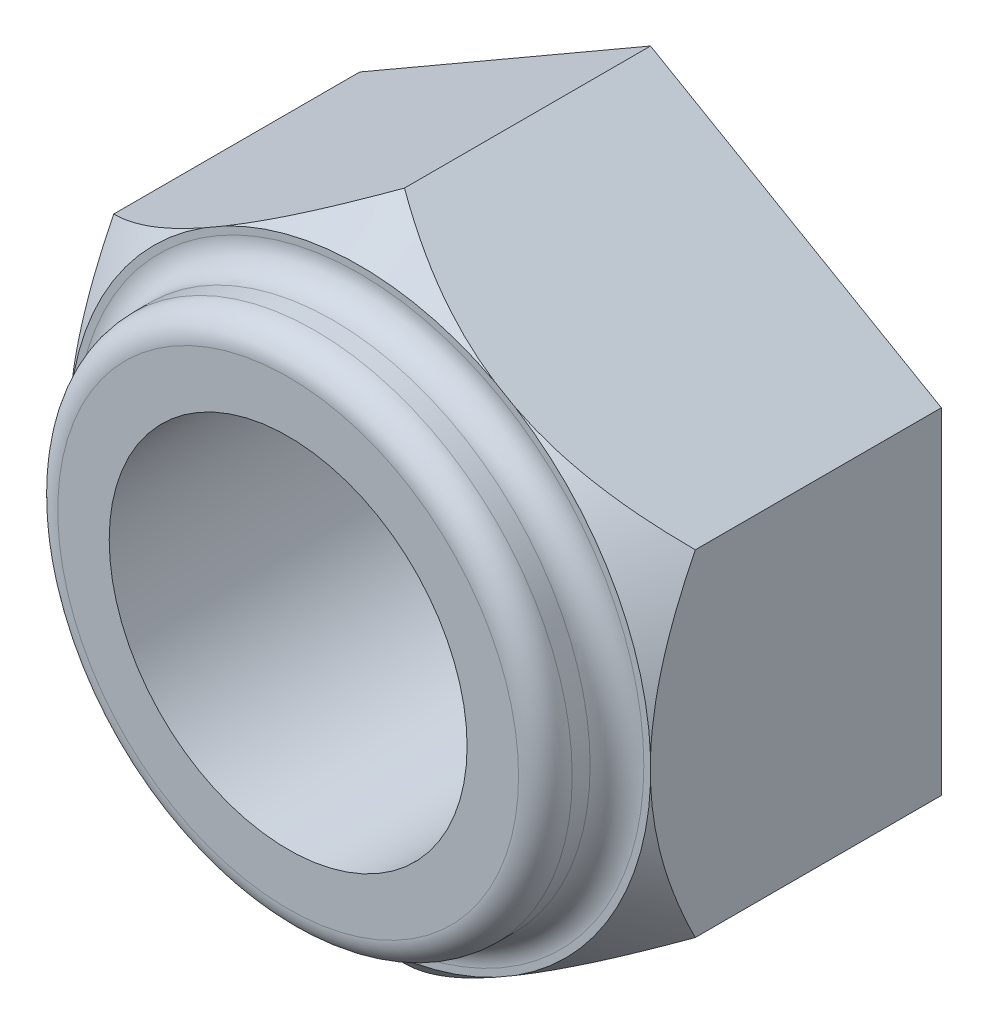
ISO-10303-21;
HEADER;
FILE_DESCRIPTION(('STEP AP214'),'2;1');
FILE_NAME('part.step','',(''),(''),'','','');
FILE_SCHEMA(('AUTOMOTIVE_DESIGN { 1 0 10303 214 1 1 1 1 }'));
ENDSEC;
DATA;
#1=APPLICATION_CONTEXT('core data for automotive mechanical design processes');
#2=APPLICATION_PROTOCOL_DEFINITION('international standard','automotive_design',2000,#1);
#3=PRODUCT_CONTEXT('',#1,'mechanical');
#4=PRODUCT('Part','Part','',(#3));
#5=PRODUCT_RELATED_PRODUCT_CATEGORY('part','',(#4));
#6=PRODUCT_DEFINITION_FORMATION('','',#4);
#7=PRODUCT_DEFINITION_CONTEXT('part definition',#1,'design');
#8=PRODUCT_DEFINITION('design','',#6,#7);
#9=PRODUCT_DEFINITION_SHAPE('','',#8);
#10=(LENGTH_UNIT() NAMED_UNIT(*) SI_UNIT(.MILLI.,.METRE.));
#11=(NAMED_UNIT(*) PLANE_ANGLE_UNIT() SI_UNIT($,.RADIAN.));
#12=(NAMED_UNIT(*) SI_UNIT($,.STERADIAN.) SOLID_ANGLE_UNIT());
#13=UNCERTAINTY_MEASURE_WITH_UNIT(LENGTH_MEASURE(1.E-05),#10,'distance_accuracy_value','');
#14=(GEOMETRIC_REPRESENTATION_CONTEXT(3) GLOBAL_UNCERTAINTY_ASSIGNED_CONTEXT((#13)) GLOBAL_UNIT_ASSIGNED_CONTEXT((#10,
#11,#12)) REPRESENTATION_CONTEXT('',''));
#15=CARTESIAN_POINT('',(0.,0.,0.));
#16=DIRECTION('',(0.,0.,1.));
#17=DIRECTION('',(1.,0.,0.));
#18=AXIS2_PLACEMENT_3D('',#15,#16,#17);
#19=CARTESIAN_POINT('',(-6.50000000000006,11.2583302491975,0.));
#20=DIRECTION('',(0.,0.,1.));
#21=DIRECTION('',(1.,0.,0.));
#22=AXIS2_PLACEMENT_3D('',#19,#20,#21);
#23=PLANE('',#22);
#24=CARTESIAN_POINT('',(0.,0.,0.));
#25=DIRECTION('',(0.,0.,1.));
#26=DIRECTION('',(1.,0.,0.));
#27=AXIS2_PLACEMENT_3D('',#24,#25,#26);
#28=CIRCLE('',#27,6.35);
#29=CARTESIAN_POINT('',(6.35000000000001,0.,0.));
#30=VERTEX_POINT('',#29);
#31=EDGE_CURVE('E174',#30,#30,#28,.F.);
#32=ORIENTED_EDGE('',*,*,#31,.T.);
#33=EDGE_LOOP('',(#32));
#34=FACE_BOUND('',#33,.T.);
#35=DIRECTION('',(0.,1.,0.));
#36=VECTOR('',#35,1.);
#37=CARTESIAN_POINT('',(6.50000000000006,-3.75277674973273,0.));
#38=LINE('',#37,#36);
#39=CARTESIAN_POINT('',(6.50000000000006,-0.268749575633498,0.));
#40=VERTEX_POINT('',#39);
#41=CARTESIAN_POINT('',(6.49999999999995,0.268749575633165,1.94289029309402E-13));
#42=VERTEX_POINT('',#41);
#43=EDGE_CURVE('E314',#40,#42,#38,.T.);
#44=ORIENTED_EDGE('',*,*,#43,.T.);
#45=CARTESIAN_POINT('',(0.,0.,0.));
#46=DIRECTION('',(0.,0.,1.));
#47=DIRECTION('',(1.,0.,0.));
#48=AXIS2_PLACEMENT_3D('',#45,#46,#47);
#49=CIRCLE('',#48,6.50555349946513);
#50=CARTESIAN_POINT('',(3.48274395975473,5.49479033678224,1.94289029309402E-13));
#51=VERTEX_POINT('',#50);
#52=EDGE_CURVE('E51',#42,#51,#49,.T.);
#53=ORIENTED_EDGE('',*,*,#52,.T.);
#54=DIRECTION('',(-0.866025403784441,0.500000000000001,0.));
#55=VECTOR('',#54,1.);
#56=CARTESIAN_POINT('',(6.49999999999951,3.75277674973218,1.94289029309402E-13));
#57=LINE('',#56,#55);
#58=CARTESIAN_POINT('',(3.01725604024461,5.76353991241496,1.94289029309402E-13));
#59=VERTEX_POINT('',#58);
#60=EDGE_CURVE('E139',#51,#59,#57,.T.);
#61=ORIENTED_EDGE('',*,*,#60,.T.);
#62=CARTESIAN_POINT('',(-3.01725604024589,5.76353991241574,1.94289029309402E-13));
#63=VERTEX_POINT('',#62);
#64=EDGE_CURVE('E338',#59,#63,#49,.T.);
#65=ORIENTED_EDGE('',*,*,#64,.T.);
#66=DIRECTION('',(-0.866025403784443,-0.500000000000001,0.));
#67=VECTOR('',#66,1.);
#68=CARTESIAN_POINT('',(-1.11022302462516E-13,7.50555349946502,1.94289029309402E-13));
#69=LINE('',#68,#67);
#70=CARTESIAN_POINT('',(-3.48274395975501,5.4947903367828,1.94289029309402E-13));
#71=VERTEX_POINT('',#70);
#72=EDGE_CURVE('E302',#63,#71,#69,.T.);
#73=ORIENTED_EDGE('',*,*,#72,.T.);
#74=CARTESIAN_POINT('',(-6.49999999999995,0.268749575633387,0.));
#75=VERTEX_POINT('',#74);
#76=EDGE_CURVE('E340',#71,#75,#49,.T.);
#77=ORIENTED_EDGE('',*,*,#76,.T.);
#78=DIRECTION('',(0.,-1.,0.));
#79=VECTOR('',#78,1.);
#80=CARTESIAN_POINT('',(-6.50000000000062,3.75277674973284,0.));
#81=LINE('',#80,#79);
#82=CARTESIAN_POINT('',(-6.49999999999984,-0.268749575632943,0.));
#83=VERTEX_POINT('',#82);
#84=EDGE_CURVE('E305',#75,#83,#81,.T.);
#85=ORIENTED_EDGE('',*,*,#84,.T.);
#86=CARTESIAN_POINT('',(-3.48274395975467,-5.49479033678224,0.));
#87=VERTEX_POINT('',#86);
#88=EDGE_CURVE('E341',#83,#87,#49,.T.);
#89=ORIENTED_EDGE('',*,*,#88,.T.);
#90=DIRECTION('',(0.866025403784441,-0.500000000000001,0.));
#91=VECTOR('',#90,1.);
#92=CARTESIAN_POINT('',(-6.49999999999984,-3.75277674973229,0.));
#93=LINE('',#92,#91);
#94=CARTESIAN_POINT('',(-3.01725604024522,-5.76353991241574,0.));
#95=VERTEX_POINT('',#94);
#96=EDGE_CURVE('E308',#87,#95,#93,.T.);
#97=ORIENTED_EDGE('',*,*,#96,.T.);
#98=CARTESIAN_POINT('',(3.01725604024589,-5.76353991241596,0.));
#99=VERTEX_POINT('',#98);
#100=EDGE_CURVE('E344',#95,#99,#49,.T.);
#101=ORIENTED_EDGE('',*,*,#100,.T.);
#102=DIRECTION('',(0.866025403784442,0.5,0.));
#103=VECTOR('',#102,1.);
#104=CARTESIAN_POINT('',(4.9960036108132E-13,-7.50555349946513,0.));
#105=LINE('',#104,#103);
#106=CARTESIAN_POINT('',(3.48274395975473,-5.49479033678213,0.));
#107=VERTEX_POINT('',#106);
#108=EDGE_CURVE('E311',#99,#107,#105,.T.);
#109=ORIENTED_EDGE('',*,*,#108,.T.);
#110=EDGE_CURVE('E59',#107,#40,#49,.T.);
#111=ORIENTED_EDGE('',*,*,#110,.T.);
#112=EDGE_LOOP('',(#44,#53,#61,#65,#73,#77,#85,#89,#97,#101,#109,#111));
#113=FACE_BOUND('',#112,.T.);
#114=ADVANCED_FACE('F31',(#34,#113),#23,.T.);
#115=CARTESIAN_POINT('',(6.49999999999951,3.7527767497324,-6.50000000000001));
#116=DIRECTION('',(0.5,0.86602540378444,0.));
#117=DIRECTION('',(-0.866025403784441,0.500000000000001,0.));
#118=AXIS2_PLACEMENT_3D('',#115,#116,#117);
#119=PLANE('',#118);
#120=ORIENTED_EDGE('',*,*,#60,.F.);
#121=CARTESIAN_POINT('',(3.47851283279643,5.49723317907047,0.000200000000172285));
#122=CARTESIAN_POINT('',(3.5679103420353,5.44561950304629,-0.00397825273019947));
#123=CARTESIAN_POINT('',(3.65720556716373,5.39406488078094,-0.010623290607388));
#124=CARTESIAN_POINT('',(3.83541266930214,5.29117696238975,-0.0286996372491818));
#125=CARTESIAN_POINT('',(3.92432462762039,5.23984361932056,-0.0401298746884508));
#126=CARTESIAN_POINT('',(4.18989853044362,5.08651445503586,-0.0813232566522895));
#127=CARTESIAN_POINT('',(4.36578196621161,4.98496810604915,-0.118008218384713));
#128=CARTESIAN_POINT('',(4.7119520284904,4.78510672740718,-0.207286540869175));
#129=CARTESIAN_POINT('',(4.88228200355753,4.68676667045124,-0.259661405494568));
#130=CARTESIAN_POINT('',(5.21932929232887,4.49217232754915,-0.37824151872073));
#131=CARTESIAN_POINT('',(5.38604537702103,4.39591875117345,-0.444451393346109));
#132=CARTESIAN_POINT('',(5.6314832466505,4.25421513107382,-0.551677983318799));
#133=CARTESIAN_POINT('',(5.71167686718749,4.20791532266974,-0.588300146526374));
#134=CARTESIAN_POINT('',(5.87114092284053,4.11584870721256,-0.664067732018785));
#135=CARTESIAN_POINT('',(5.95041161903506,4.07008174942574,-0.703212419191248));
#136=CARTESIAN_POINT('',(6.10860404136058,3.97874931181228,-0.784078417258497));
#137=CARTESIAN_POINT('',(6.18751971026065,3.93318732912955,-0.825815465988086));
#138=CARTESIAN_POINT('',(6.34449667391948,3.84255663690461,-0.911420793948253));
#139=CARTESIAN_POINT('',(6.42255781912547,3.79748801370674,-0.955289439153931));
#140=CARTESIAN_POINT('',(6.50019999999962,3.75266127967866,-1.0001154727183));
#141=B_SPLINE_CURVE_WITH_KNOTS('',3,(#121,#122,#123,#124,#125,#126,#127,#128,#129,#130,#131,
#132,#133,#134,#135,#136,#137,#138,#139,#140),.UNSPECIFIED.,.F.,.F.,(4,2,2,2,2,2,2,2,2,4),(0.,
0.309873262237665,0.619677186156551,1.23796054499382,1.84800516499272,2.45825409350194,
2.75696104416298,3.05558133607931,3.3562361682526,3.65694280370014),.UNSPECIFIED.);
#142=CARTESIAN_POINT('',(6.49999999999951,3.75277674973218,-0.999999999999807));
#143=VERTEX_POINT('',#142);
#144=EDGE_CURVE('E125',#51,#143,#141,.T.);
#145=ORIENTED_EDGE('',*,*,#144,.T.);
#146=DIRECTION('',(0.,0.,1.));
#147=VECTOR('',#146,1.);
#148=CARTESIAN_POINT('',(6.49999999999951,3.7527767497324,-6.50000000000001));
#149=LINE('',#148,#147);
#150=CARTESIAN_POINT('',(6.49999999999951,3.7527767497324,-6.50000000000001));
#151=VERTEX_POINT('',#150);
#152=EDGE_CURVE('E135',#151,#143,#149,.T.);
#153=ORIENTED_EDGE('',*,*,#152,.F.);
#154=DIRECTION('',(-0.866025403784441,0.500000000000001,0.));
#155=VECTOR('',#154,1.);
#156=CARTESIAN_POINT('',(6.49999999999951,3.7527767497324,-6.50000000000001));
#157=LINE('',#156,#155);
#158=CARTESIAN_POINT('',(-1.11022302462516E-13,7.50555349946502,-6.49999999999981));
#159=VERTEX_POINT('',#158);
#160=EDGE_CURVE('E316',#151,#159,#157,.T.);
#161=ORIENTED_EDGE('',*,*,#160,.T.);
#162=DIRECTION('',(0.,0.,1.));
#163=VECTOR('',#162,1.);
#164=CARTESIAN_POINT('',(-1.11022302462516E-13,7.50555349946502,-6.49999999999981));
#165=LINE('',#164,#163);
#166=CARTESIAN_POINT('',(-1.11022302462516E-13,7.50555349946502,-0.999999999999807));
#167=VERTEX_POINT('',#166);
#168=EDGE_CURVE('E166',#159,#167,#165,.T.);
#169=ORIENTED_EDGE('',*,*,#168,.T.);
#170=CARTESIAN_POINT('',(-0.00020000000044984,7.50566896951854,-1.0001154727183));
#171=CARTESIAN_POINT('',(0.0946604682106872,7.45090125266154,-0.945351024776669));
#172=CARTESIAN_POINT('',(0.190138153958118,7.39577718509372,-0.892016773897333));
#173=CARTESIAN_POINT('',(0.382429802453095,7.28475755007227,-0.788572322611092));
#174=CARTESIAN_POINT('',(0.479244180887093,7.22886174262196,-0.738463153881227));
#175=CARTESIAN_POINT('',(0.772467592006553,7.05956912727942,-0.593216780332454));
#176=CARTESIAN_POINT('',(0.970963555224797,6.94496742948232,-0.503567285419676));
#177=CARTESIAN_POINT('',(1.36924758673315,6.71501803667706,-0.344321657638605));
#178=CARTESIAN_POINT('',(1.5689191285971,6.5997376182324,-0.274340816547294));
#179=CARTESIAN_POINT('',(1.97273064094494,6.36659693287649,-0.15587332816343));
#180=CARTESIAN_POINT('',(2.17686159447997,6.24874187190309,-0.107346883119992));
#181=CARTESIAN_POINT('',(2.4881199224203,6.06903679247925,-0.0526022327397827));
#182=CARTESIAN_POINT('',(2.5940807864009,6.00786025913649,-0.0372885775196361));
#183=CARTESIAN_POINT('',(2.80713727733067,5.88485203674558,-0.0133715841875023));
#184=CARTESIAN_POINT('',(2.91423594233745,5.82301859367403,-0.00480445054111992));
#185=CARTESIAN_POINT('',(3.02148716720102,5.76109707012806,0.000200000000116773));
#186=B_SPLINE_CURVE_WITH_KNOTS('',3,(#170,#171,#172,#173,#174,#175,#176,#177,#178,#179,#180,
#181,#182,#183,#184,#185),.UNSPECIFIED.,.F.,.F.,(4,2,2,2,2,2,2,4),(0.,0.367367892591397,
0.734852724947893,1.4725117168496,2.19453828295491,2.9152198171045,3.28497390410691,
3.65669896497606),.UNSPECIFIED.);
#187=EDGE_CURVE('E204',#167,#59,#186,.T.);
#188=ORIENTED_EDGE('',*,*,#187,.T.);
#189=EDGE_LOOP('',(#120,#145,#153,#161,#169,#188));
#190=FACE_BOUND('',#189,.T.);
#191=ADVANCED_FACE('F33',(#190),#119,.T.);
#192=CARTESIAN_POINT('',(6.50000000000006,-3.75277674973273,-6.50000000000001));
#193=DIRECTION('',(1.,0.,0.));
#194=DIRECTION('',(0.,1.,0.));
#195=AXIS2_PLACEMENT_3D('',#192,#193,#194);
#196=PLANE('',#195);
#197=ORIENTED_EDGE('',*,*,#152,.T.);
#198=CARTESIAN_POINT('',(6.50000000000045,-7.83397785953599,-3.67389683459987));
#199=CARTESIAN_POINT('',(6.5000000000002,-7.64472126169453,-3.52828002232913));
#200=CARTESIAN_POINT('',(6.5000000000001,-7.45444516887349,-3.38396741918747));
#201=CARTESIAN_POINT('',(6.50000000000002,-7.07143720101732,-3.0985465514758));
#202=CARTESIAN_POINT('',(6.50000000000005,-6.87870475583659,-2.95743905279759));
#203=CARTESIAN_POINT('',(6.50000000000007,-6.48895888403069,-2.67802013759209));
#204=CARTESIAN_POINT('',(6.50000000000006,-6.29192390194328,-2.53973868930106));
#205=CARTESIAN_POINT('',(6.50000000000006,-5.89457513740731,-2.26798589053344));
#206=CARTESIAN_POINT('',(6.50000000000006,-5.69426158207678,-2.13451420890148));
#207=CARTESIAN_POINT('',(6.50000000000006,-5.27697243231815,-1.86519528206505));
#208=CARTESIAN_POINT('',(6.50000000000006,-5.05974606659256,-1.72973463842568));
#209=CARTESIAN_POINT('',(6.50000000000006,-4.62019196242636,-1.46721809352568));
#210=CARTESIAN_POINT('',(6.50000000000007,-4.39786337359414,-1.34016360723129));
#211=CARTESIAN_POINT('',(6.50000000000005,-3.94804348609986,-1.09716494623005));
#212=CARTESIAN_POINT('',(6.50000000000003,-3.72056994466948,-0.981188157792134));
#213=CARTESIAN_POINT('',(6.50000000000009,-3.2591910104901,-0.76294333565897));
#214=CARTESIAN_POINT('',(6.50000000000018,-3.02528871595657,-0.660668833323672));
#215=CARTESIAN_POINT('',(6.50000000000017,-2.57399161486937,-0.482780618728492));
#216=CARTESIAN_POINT('',(6.50000000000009,-2.35724810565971,-0.405531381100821));
#217=CARTESIAN_POINT('',(6.50000000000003,-1.91823719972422,-0.268381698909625));
#218=CARTESIAN_POINT('',(6.50000000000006,-1.69596945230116,-0.208482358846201));
#219=CARTESIAN_POINT('',(6.50000000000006,-1.2511098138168,-0.110273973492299));
#220=CARTESIAN_POINT('',(6.50000000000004,-1.0286060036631,-0.0715726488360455));
#221=CARTESIAN_POINT('',(6.50000000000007,-0.580831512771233,-0.0165680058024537));
#222=CARTESIAN_POINT('',(6.50000000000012,-0.355561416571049,-0.000260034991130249));
#223=CARTESIAN_POINT('',(6.50000000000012,0.0855836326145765,0.00856763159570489));
#224=CARTESIAN_POINT('',(6.50000000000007,0.301438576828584,0.00209655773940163));
#225=CARTESIAN_POINT('',(6.50000000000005,0.731465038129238,-0.031959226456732));
#226=CARTESIAN_POINT('',(6.50000000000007,0.945636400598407,-0.0595458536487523));
#227=CARTESIAN_POINT('',(6.50000000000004,1.37437544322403,-0.134741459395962));
#228=CARTESIAN_POINT('',(6.49999999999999,1.5888800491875,-0.182704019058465));
#229=CARTESIAN_POINT('',(6.50000000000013,2.01316513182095,-0.295989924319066));
#230=CARTESIAN_POINT('',(6.50000000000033,2.22294587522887,-0.361312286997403));
#231=CARTESIAN_POINT('',(6.50000000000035,2.64929633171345,-0.510614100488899));
#232=CARTESIAN_POINT('',(6.50000000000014,2.86556248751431,-0.595450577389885));
#233=CARTESIAN_POINT('',(6.49999999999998,3.29253231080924,-0.778230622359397));
#234=CARTESIAN_POINT('',(6.50000000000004,3.503233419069,-0.876180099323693));
#235=CARTESIAN_POINT('',(6.50000000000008,3.92006800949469,-1.08286332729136));
#236=CARTESIAN_POINT('',(6.50000000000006,4.1261848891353,-1.191630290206));
#237=CARTESIAN_POINT('',(6.50000000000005,4.53369568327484,-1.4175550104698));
#238=CARTESIAN_POINT('',(6.50000000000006,4.73509031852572,-1.53471147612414));
#239=CARTESIAN_POINT('',(6.50000000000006,5.12393114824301,-1.76982560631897));
#240=CARTESIAN_POINT('',(6.50000000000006,5.31157504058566,-1.88745803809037));
#241=CARTESIAN_POINT('',(6.50000000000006,5.68363895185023,-2.12773023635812));
#242=CARTESIAN_POINT('',(6.50000000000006,5.86805872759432,-2.25037037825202));
#243=CARTESIAN_POINT('',(6.50000000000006,6.23261356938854,-2.49876669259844));
#244=CARTESIAN_POINT('',(6.50000000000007,6.41277114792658,-2.62448994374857));
#245=CARTESIAN_POINT('',(6.50000000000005,6.77061474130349,-2.87930687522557));
#246=CARTESIAN_POINT('',(6.50000000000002,6.94830142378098,-3.00839961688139));
#247=CARTESIAN_POINT('',(6.49999999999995,7.12495159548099,-3.13887158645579));
#248=B_SPLINE_CURVE_WITH_KNOTS('',3,(#198,#199,#200,#201,#202,#203,#204,#205,#206,#207,#208,
#209,#210,#211,#212,#213,#214,#215,#216,#217,#218,#219,#220,#221,#222,#223,#224,#225,#226,#227,
#228,#229,#230,#231,#232,#233,#234,#235,#236,#237,#238,#239,#240,#241,#242,#243,#244,#245,#246,
#247),.UNSPECIFIED.,.F.,.F.,(4,2,2,2,2,2,2,2,2,2,2,2,2,2,2,2,2,2,2,2,2,2,2,2,4),(0.,
0.716393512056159,1.43295644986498,2.15504732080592,2.87708837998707,3.64494230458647,
4.41292515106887,5.17857239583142,5.94385690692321,6.6335567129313,7.32330041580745,
7.99980722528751,8.67617346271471,9.32295751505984,9.96980028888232,10.6283582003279,
11.2868788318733,11.983277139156,12.679990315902,13.378912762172,14.0777278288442,
14.7420355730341,15.4063932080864,16.0654171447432,16.7242594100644),.UNSPECIFIED.);
#249=EDGE_CURVE('E122',#143,#42,#248,.F.);
#250=ORIENTED_EDGE('',*,*,#249,.T.);
#251=ORIENTED_EDGE('',*,*,#43,.F.);
#252=CARTESIAN_POINT('',(6.50000000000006,-3.75277674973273,-1.));
#253=VERTEX_POINT('',#252);
#254=EDGE_CURVE('E130',#40,#253,#248,.F.);
#255=ORIENTED_EDGE('',*,*,#254,.T.);
#256=DIRECTION('',(0.,0.,1.));
#257=VECTOR('',#256,1.);
#258=CARTESIAN_POINT('',(6.50000000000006,-3.75277674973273,-6.50000000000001));
#259=LINE('',#258,#257);
#260=CARTESIAN_POINT('',(6.50000000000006,-3.75277674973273,-6.50000000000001));
#261=VERTEX_POINT('',#260);
#262=EDGE_CURVE('E147',#261,#253,#259,.T.);
#263=ORIENTED_EDGE('',*,*,#262,.F.);
#264=DIRECTION('',(0.,1.,0.));
#265=VECTOR('',#264,1.);
#266=CARTESIAN_POINT('',(6.50000000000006,-3.75277674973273,-6.50000000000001));
#267=LINE('',#266,#265);
#268=EDGE_CURVE('E145',#261,#151,#267,.T.);
#269=ORIENTED_EDGE('',*,*,#268,.T.);
#270=EDGE_LOOP('',(#197,#250,#251,#255,#263,#269));
#271=FACE_BOUND('',#270,.T.);
#272=ADVANCED_FACE('F143',(#271),#196,.T.);
#273=CARTESIAN_POINT('',(4.9960036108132E-13,-7.50555349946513,-6.50000000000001));
#274=DIRECTION('',(0.500000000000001,-0.866025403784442,0.));
#275=DIRECTION('',(0.866025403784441,0.5,0.));
#276=AXIS2_PLACEMENT_3D('',#273,#274,#275);
#277=PLANE('',#276);
#278=ORIENTED_EDGE('',*,*,#108,.F.);
#279=CARTESIAN_POINT('',(3.02148716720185,-5.76109707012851,0.000199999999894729));
#280=CARTESIAN_POINT('',(2.93208965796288,-5.81271074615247,-0.00397825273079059));
#281=CARTESIAN_POINT('',(2.84279443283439,-5.86426536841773,-0.010623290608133));
#282=CARTESIAN_POINT('',(2.66458733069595,-5.96715328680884,-0.0286996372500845));
#283=CARTESIAN_POINT('',(2.5756753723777,-6.01848662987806,-0.0401298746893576));
#284=CARTESIAN_POINT('',(2.31010146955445,-6.17181579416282,-0.0813232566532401));
#285=CARTESIAN_POINT('',(2.1342180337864,-6.27336214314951,-0.118008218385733));
#286=CARTESIAN_POINT('',(1.78804797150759,-6.47322352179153,-0.207286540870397));
#287=CARTESIAN_POINT('',(1.61771799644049,-6.57156357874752,-0.259661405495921));
#288=CARTESIAN_POINT('',(1.28067070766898,-6.76615792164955,-0.378241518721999));
#289=CARTESIAN_POINT('',(1.11395462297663,-6.86241149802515,-0.444451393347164));
#290=CARTESIAN_POINT('',(0.868516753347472,-7.00411511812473,-0.551677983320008));
#291=CARTESIAN_POINT('',(0.788323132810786,-7.05041492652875,-0.588300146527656));
#292=CARTESIAN_POINT('',(0.62885907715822,-7.14248154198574,-0.664067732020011));
#293=CARTESIAN_POINT('',(0.549588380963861,-7.18824849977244,-0.703212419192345));
#294=CARTESIAN_POINT('',(0.391395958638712,-7.27958093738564,-0.784078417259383));
#295=CARTESIAN_POINT('',(0.312480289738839,-7.32514292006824,-0.82581546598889));
#296=CARTESIAN_POINT('',(0.155503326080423,-7.41577361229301,-0.911420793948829));
#297=CARTESIAN_POINT('',(0.0774421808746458,-7.46084223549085,-0.955289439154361));
#298=CARTESIAN_POINT('',(-0.000199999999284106,-7.50566896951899,-1.0001154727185));
#299=B_SPLINE_CURVE_WITH_KNOTS('',3,(#279,#280,#281,#282,#283,#284,#285,#286,#287,#288,#289,
#290,#291,#292,#293,#294,#295,#296,#297,#298),.UNSPECIFIED.,.F.,.F.,(4,2,2,2,2,2,2,2,2,4),(0.,
0.309873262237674,0.619677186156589,1.237960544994,1.84800516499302,2.45825409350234,
2.75696104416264,3.05558133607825,3.3562361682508,3.65694280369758),.UNSPECIFIED.);
#300=CARTESIAN_POINT('',(4.9960036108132E-13,-7.50555349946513,-1.));
#301=VERTEX_POINT('',#300);
#302=EDGE_CURVE('E223',#99,#301,#299,.T.);
#303=ORIENTED_EDGE('',*,*,#302,.T.);
#304=DIRECTION('',(0.,0.,1.));
#305=VECTOR('',#304,1.);
#306=CARTESIAN_POINT('',(4.9960036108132E-13,-7.50555349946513,-6.50000000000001));
#307=LINE('',#306,#305);
#308=CARTESIAN_POINT('',(4.9960036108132E-13,-7.50555349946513,-6.50000000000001));
#309=VERTEX_POINT('',#308);
#310=EDGE_CURVE('E153',#309,#301,#307,.T.);
#311=ORIENTED_EDGE('',*,*,#310,.F.);
#312=DIRECTION('',(0.866025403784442,0.5,0.));
#313=VECTOR('',#312,1.);
#314=CARTESIAN_POINT('',(4.9960036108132E-13,-7.50555349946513,-6.50000000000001));
#315=LINE('',#314,#313);
#316=EDGE_CURVE('E326',#309,#261,#315,.T.);
#317=ORIENTED_EDGE('',*,*,#316,.T.);
#318=ORIENTED_EDGE('',*,*,#262,.T.);
#319=CARTESIAN_POINT('',(6.50020000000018,-3.75266127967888,-1.0001154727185));
#320=CARTESIAN_POINT('',(6.40533953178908,-3.80742899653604,-0.945351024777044));
#321=CARTESIAN_POINT('',(6.30986184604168,-3.86255306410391,-0.892016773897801));
#322=CARTESIAN_POINT('',(6.11757019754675,-3.97357269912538,-0.788572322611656));
#323=CARTESIAN_POINT('',(6.02075581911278,-4.02946850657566,-0.738463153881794));
#324=CARTESIAN_POINT('',(5.72753240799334,-4.19876112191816,-0.593216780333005));
#325=CARTESIAN_POINT('',(5.52903644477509,-4.31336281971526,-0.503567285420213));
#326=CARTESIAN_POINT('',(5.13075241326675,-4.54331221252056,-0.344321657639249));
#327=CARTESIAN_POINT('',(4.93108087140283,-4.65859263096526,-0.274340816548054));
#328=CARTESIAN_POINT('',(4.52726935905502,-4.89173331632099,-0.155873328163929));
#329=CARTESIAN_POINT('',(4.32313840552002,-5.00958837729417,-0.107346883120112));
#330=CARTESIAN_POINT('',(4.01188007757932,-5.18929345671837,-0.0526022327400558));
#331=CARTESIAN_POINT('',(3.90591921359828,-5.2504699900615,-0.0372885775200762));
#332=CARTESIAN_POINT('',(3.69286272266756,-5.373478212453,-0.0133715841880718));
#333=CARTESIAN_POINT('',(3.58576405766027,-5.43531165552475,-0.00480445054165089));
#334=CARTESIAN_POINT('',(3.4785128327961,-5.49723317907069,0.000200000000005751));
#335=B_SPLINE_CURVE_WITH_KNOTS('',3,(#319,#320,#321,#322,#323,#324,#325,#326,#327,#328,#329,
#330,#331,#332,#333,#334),.UNSPECIFIED.,.F.,.F.,(4,2,2,2,2,2,2,4),(0.,0.367367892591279,
0.734852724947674,1.47251171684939,2.19453828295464,2.91521981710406,3.28497390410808,
3.65669896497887),.UNSPECIFIED.);
#336=EDGE_CURVE('E229',#253,#107,#335,.T.);
#337=ORIENTED_EDGE('',*,*,#336,.T.);
#338=EDGE_LOOP('',(#278,#303,#311,#317,#318,#337));
#339=FACE_BOUND('',#338,.T.);
#340=ADVANCED_FACE('F245',(#339),#277,.T.);
#341=CARTESIAN_POINT('',(-6.49999999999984,-3.75277674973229,-6.50000000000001));
#342=DIRECTION('',(-0.500000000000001,-0.86602540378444,0.));
#343=DIRECTION('',(0.866025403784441,-0.500000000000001,0.));
#344=AXIS2_PLACEMENT_3D('',#341,#342,#343);
#345=PLANE('',#344);
#346=ORIENTED_EDGE('',*,*,#96,.F.);
#347=CARTESIAN_POINT('',(-3.4785128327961,-5.4972331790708,0.000200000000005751));
#348=CARTESIAN_POINT('',(-3.56791034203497,-5.44561950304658,-0.00397825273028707));
#349=CARTESIAN_POINT('',(-3.65720556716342,-5.39406488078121,-0.0106232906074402));
#350=CARTESIAN_POINT('',(-3.83541266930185,-5.29117696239,-0.0286996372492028));
#351=CARTESIAN_POINT('',(-3.92432462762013,-5.2398436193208,-0.040129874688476));
#352=CARTESIAN_POINT('',(-4.18989853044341,-5.08651445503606,-0.0813232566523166));
#353=CARTESIAN_POINT('',(-4.36578196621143,-4.98496810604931,-0.118008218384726));
#354=CARTESIAN_POINT('',(-4.71195202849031,-4.78510672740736,-0.207286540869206));
#355=CARTESIAN_POINT('',(-4.8822820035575,-4.68676667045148,-0.259661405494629));
#356=CARTESIAN_POINT('',(-5.21932929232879,-4.49217232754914,-0.378241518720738));
#357=CARTESIAN_POINT('',(-5.38604537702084,-4.39591875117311,-0.444451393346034));
#358=CARTESIAN_POINT('',(-5.63148324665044,-4.25421513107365,-0.551677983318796));
#359=CARTESIAN_POINT('',(-5.71167686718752,-4.20791532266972,-0.588300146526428));
#360=CARTESIAN_POINT('',(-5.87114092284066,-4.11584870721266,-0.664067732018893));
#361=CARTESIAN_POINT('',(-5.95041161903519,-4.07008174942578,-0.703212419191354));
#362=CARTESIAN_POINT('',(-6.10860404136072,-3.97874931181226,-0.784078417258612));
#363=CARTESIAN_POINT('',(-6.18751971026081,-3.93318732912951,-0.825815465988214));
#364=CARTESIAN_POINT('',(-6.3444966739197,-3.8425566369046,-0.911420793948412));
#365=CARTESIAN_POINT('',(-6.42255781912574,-3.79748801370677,-0.955289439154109));
#366=CARTESIAN_POINT('',(-6.50019999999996,-3.75266127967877,-1.0001154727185));
#367=B_SPLINE_CURVE_WITH_KNOTS('',3,(#347,#348,#349,#350,#351,#352,#353,#354,#355,#356,#357,
#358,#359,#360,#361,#362,#363,#364,#365,#366),.UNSPECIFIED.,.F.,.F.,(4,2,2,2,2,2,2,2,2,4),(0.,
0.309873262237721,0.619677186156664,1.23796054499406,1.84800516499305,2.45825409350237,
2.75696104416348,3.05558133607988,3.35623616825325,3.65694280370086),.UNSPECIFIED.);
#368=CARTESIAN_POINT('',(-6.49999999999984,-3.75277674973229,-1.));
#369=VERTEX_POINT('',#368);
#370=EDGE_CURVE('E210',#87,#369,#367,.T.);
#371=ORIENTED_EDGE('',*,*,#370,.T.);
#372=DIRECTION('',(0.,0.,1.));
#373=VECTOR('',#372,1.);
#374=CARTESIAN_POINT('',(-6.49999999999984,-3.75277674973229,-6.50000000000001));
#375=LINE('',#374,#373);
#376=CARTESIAN_POINT('',(-6.49999999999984,-3.75277674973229,-6.50000000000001));
#377=VERTEX_POINT('',#376);
#378=EDGE_CURVE('E160',#377,#369,#375,.T.);
#379=ORIENTED_EDGE('',*,*,#378,.F.);
#380=DIRECTION('',(0.866025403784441,-0.500000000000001,0.));
#381=VECTOR('',#380,1.);
#382=CARTESIAN_POINT('',(-6.49999999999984,-3.75277674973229,-6.50000000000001));
#383=LINE('',#382,#381);
#384=EDGE_CURVE('E324',#377,#309,#383,.T.);
#385=ORIENTED_EDGE('',*,*,#384,.T.);
#386=ORIENTED_EDGE('',*,*,#310,.T.);
#387=CARTESIAN_POINT('',(0.000200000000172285,-7.50566896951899,-1.0001154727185));
#388=CARTESIAN_POINT('',(-0.0946604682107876,-7.45090125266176,-0.945351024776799));
#389=CARTESIAN_POINT('',(-0.190138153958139,-7.39577718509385,-0.892016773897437));
#390=CARTESIAN_POINT('',(-0.382429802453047,-7.28475755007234,-0.788572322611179));
#391=CARTESIAN_POINT('',(-0.479244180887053,-7.22886174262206,-0.738463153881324));
#392=CARTESIAN_POINT('',(-0.772467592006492,-7.05956912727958,-0.593216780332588));
#393=CARTESIAN_POINT('',(-0.970963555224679,-6.94496742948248,-0.50356728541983));
#394=CARTESIAN_POINT('',(-1.36924758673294,-6.71501803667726,-0.344321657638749));
#395=CARTESIAN_POINT('',(-1.56891912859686,-6.59973761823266,-0.274340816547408));
#396=CARTESIAN_POINT('',(-1.97273064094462,-6.36659693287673,-0.155873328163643));
#397=CARTESIAN_POINT('',(-2.1768615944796,-6.24874187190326,-0.107346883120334));
#398=CARTESIAN_POINT('',(-2.48811992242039,-6.06903679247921,-0.0526022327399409));
#399=CARTESIAN_POINT('',(-2.59408078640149,-6.00786025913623,-0.0372885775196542));
#400=CARTESIAN_POINT('',(-2.80713727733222,-5.88485203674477,-0.0133715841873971));
#401=CARTESIAN_POINT('',(-2.91423594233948,-5.82301859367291,-0.0048044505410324));
#402=CARTESIAN_POINT('',(-3.02148716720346,-5.76109707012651,0.000200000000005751));
#403=B_SPLINE_CURVE_WITH_KNOTS('',3,(#387,#388,#389,#390,#391,#392,#393,#394,#395,#396,#397,
#398,#399,#400,#401,#402),.UNSPECIFIED.,.F.,.F.,(4,2,2,2,2,2,2,4),(0.,0.36736789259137,
0.734852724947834,1.47251171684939,2.19453828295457,2.91521981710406,3.28497390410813,
3.65669896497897),.UNSPECIFIED.);
#404=EDGE_CURVE('E217',#301,#95,#403,.T.);
#405=ORIENTED_EDGE('',*,*,#404,.T.);
#406=EDGE_LOOP('',(#346,#371,#379,#385,#386,#405));
#407=FACE_BOUND('',#406,.T.);
#408=ADVANCED_FACE('F250',(#407),#345,.T.);
#409=CARTESIAN_POINT('',(-6.50000000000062,3.75277674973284,-6.50000000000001));
#410=DIRECTION('',(-1.,0.,0.));
#411=DIRECTION('',(0.,-1.,0.));
#412=AXIS2_PLACEMENT_3D('',#409,#410,#411);
#413=PLANE('',#412);
#414=ORIENTED_EDGE('',*,*,#378,.T.);
#415=CARTESIAN_POINT('',(-6.49999999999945,-7.83397785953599,-3.67389683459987));
#416=CARTESIAN_POINT('',(-6.5000000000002,-7.64472126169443,-3.52828002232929));
#417=CARTESIAN_POINT('',(-6.50000000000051,-7.45444516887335,-3.3839674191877));
#418=CARTESIAN_POINT('',(-6.50000000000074,-7.07143720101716,-3.09854655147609));
#419=CARTESIAN_POINT('',(-6.50000000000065,-6.87870475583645,-2.95743905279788));
#420=CARTESIAN_POINT('',(-6.50000000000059,-6.48895888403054,-2.67802013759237));
#421=CARTESIAN_POINT('',(-6.50000000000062,-6.29192390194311,-2.53973868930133));
#422=CARTESIAN_POINT('',(-6.50000000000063,-5.89457513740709,-2.26798589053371));
#423=CARTESIAN_POINT('',(-6.50000000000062,-5.69426158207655,-2.13451420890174));
#424=CARTESIAN_POINT('',(-6.50000000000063,-5.27697243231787,-1.86519528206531));
#425=CARTESIAN_POINT('',(-6.50000000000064,-5.05974606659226,-1.72973463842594));
#426=CARTESIAN_POINT('',(-6.5000000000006,-4.62019196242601,-1.46721809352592));
#427=CARTESIAN_POINT('',(-6.50000000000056,-4.39786337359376,-1.3401636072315));
#428=CARTESIAN_POINT('',(-6.50000000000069,-3.94804348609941,-1.09716494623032));
#429=CARTESIAN_POINT('',(-6.50000000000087,-3.72056994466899,-0.981188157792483));
#430=CARTESIAN_POINT('',(-6.50000000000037,-3.25919101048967,-0.762943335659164));
#431=CARTESIAN_POINT('',(-6.49999999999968,-3.02528871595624,-0.660668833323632));
#432=CARTESIAN_POINT('',(-6.49999999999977,-2.57399161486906,-0.482780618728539));
#433=CARTESIAN_POINT('',(-6.50000000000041,-2.35724810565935,-0.405531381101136));
#434=CARTESIAN_POINT('',(-6.50000000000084,-1.91823719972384,-0.268381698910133));
#435=CARTESIAN_POINT('',(-6.50000000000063,-1.69596945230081,-0.208482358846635));
#436=CARTESIAN_POINT('',(-6.50000000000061,-1.25110981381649,-0.110273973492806));
#437=CARTESIAN_POINT('',(-6.50000000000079,-1.0286060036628,-0.0715726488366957));
#438=CARTESIAN_POINT('',(-6.50000000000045,-0.580831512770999,-0.016568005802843));
#439=CARTESIAN_POINT('',(-6.49999999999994,-0.35556141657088,-0.000260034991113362));
#440=CARTESIAN_POINT('',(-6.49999999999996,0.0855836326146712,0.00856763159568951));
#441=CARTESIAN_POINT('',(-6.50000000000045,0.30143857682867,0.00209655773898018));
#442=CARTESIAN_POINT('',(-6.50000000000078,0.73146503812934,-0.0319592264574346));
#443=CARTESIAN_POINT('',(-6.50000000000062,0.945636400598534,-0.0595458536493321));
#444=CARTESIAN_POINT('',(-6.50000000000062,1.37437544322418,-0.134741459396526));
#445=CARTESIAN_POINT('',(-6.50000000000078,1.58888004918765,-0.182704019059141));
#446=CARTESIAN_POINT('',(-6.50000000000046,2.01316513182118,-0.295989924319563));
#447=CARTESIAN_POINT('',(-6.49999999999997,2.2229458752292,-0.361312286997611));
#448=CARTESIAN_POINT('',(-6.49999999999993,2.64929633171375,-0.510614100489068));
#449=CARTESIAN_POINT('',(-6.50000000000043,2.86556248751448,-0.595450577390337));
#450=CARTESIAN_POINT('',(-6.5000000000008,3.2925323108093,-0.778230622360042));
#451=CARTESIAN_POINT('',(-6.50000000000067,3.50323341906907,-0.876180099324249));
#452=CARTESIAN_POINT('',(-6.50000000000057,3.92006800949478,-1.08286332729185));
#453=CARTESIAN_POINT('',(-6.5000000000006,4.12618488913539,-1.19163029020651));
#454=CARTESIAN_POINT('',(-6.50000000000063,4.53369568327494,-1.41755501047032));
#455=CARTESIAN_POINT('',(-6.50000000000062,4.73509031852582,-1.53471147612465));
#456=CARTESIAN_POINT('',(-6.50000000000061,5.12393114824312,-1.76982560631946));
#457=CARTESIAN_POINT('',(-6.50000000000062,5.31157504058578,-1.88745803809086));
#458=CARTESIAN_POINT('',(-6.50000000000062,5.68363895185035,-2.12773023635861));
#459=CARTESIAN_POINT('',(-6.50000000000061,5.86805872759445,-2.2503703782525));
#460=CARTESIAN_POINT('',(-6.50000000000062,6.23261356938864,-2.49876669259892));
#461=CARTESIAN_POINT('',(-6.50000000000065,6.41277114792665,-2.62448994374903));
#462=CARTESIAN_POINT('',(-6.50000000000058,6.77061474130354,-2.87930687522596));
#463=CARTESIAN_POINT('',(-6.5000000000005,6.94830142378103,-3.00839961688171));
#464=CARTESIAN_POINT('',(-6.50000000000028,7.1249515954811,-3.13887158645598));
#465=B_SPLINE_CURVE_WITH_KNOTS('',3,(#415,#416,#417,#418,#419,#420,#421,#422,#423,#424,#425,
#426,#427,#428,#429,#430,#431,#432,#433,#434,#435,#436,#437,#438,#439,#440,#441,#442,#443,#444,
#445,#446,#447,#448,#449,#450,#451,#452,#453,#454,#455,#456,#457,#458,#459,#460,#461,#462,#463,
#464),.UNSPECIFIED.,.F.,.F.,(4,2,2,2,2,2,2,2,2,2,2,2,2,2,2,2,2,2,2,2,2,2,2,2,4),(0.,
0.716393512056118,1.43295644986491,2.15504732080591,2.87708837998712,3.64494230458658,
4.41292515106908,5.17857239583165,5.94385690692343,6.63355671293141,7.32330041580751,
7.99980722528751,8.67617346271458,9.3229575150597,9.96980028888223,10.6283582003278,
11.2868788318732,11.9832771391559,12.6799903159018,13.3789127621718,14.0777278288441,
14.742035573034,15.4063932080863,16.0654171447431,16.7242594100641),.UNSPECIFIED.);
#466=EDGE_CURVE('E350',#369,#83,#465,.T.);
#467=ORIENTED_EDGE('',*,*,#466,.T.);
#468=ORIENTED_EDGE('',*,*,#84,.F.);
#469=CARTESIAN_POINT('',(-6.50000000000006,3.75277674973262,-1.));
#470=VERTEX_POINT('',#469);
#471=EDGE_CURVE('E197',#75,#470,#465,.T.);
#472=ORIENTED_EDGE('',*,*,#471,.T.);
#473=DIRECTION('',(0.,0.,1.));
#474=VECTOR('',#473,1.);
#475=CARTESIAN_POINT('',(-6.50000000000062,3.75277674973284,-6.50000000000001));
#476=LINE('',#475,#474);
#477=CARTESIAN_POINT('',(-6.50000000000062,3.75277674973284,-6.50000000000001));
#478=VERTEX_POINT('',#477);
#479=EDGE_CURVE('E163',#478,#470,#476,.T.);
#480=ORIENTED_EDGE('',*,*,#479,.F.);
#481=DIRECTION('',(0.,-1.,0.));
#482=VECTOR('',#481,1.);
#483=CARTESIAN_POINT('',(-6.50000000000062,3.75277674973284,-6.50000000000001));
#484=LINE('',#483,#482);
#485=EDGE_CURVE('E321',#478,#377,#484,.T.);
#486=ORIENTED_EDGE('',*,*,#485,.T.);
#487=EDGE_LOOP('',(#414,#467,#468,#472,#480,#486));
#488=FACE_BOUND('',#487,.T.);
#489=ADVANCED_FACE('F255',(#488),#413,.T.);
#490=CARTESIAN_POINT('',(-1.11022302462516E-13,7.50555349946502,-6.49999999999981));
#491=DIRECTION('',(-0.500000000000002,0.866025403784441,0.));
#492=DIRECTION('',(-0.866025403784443,-0.500000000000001,0.));
#493=AXIS2_PLACEMENT_3D('',#490,#491,#492);
#494=PLANE('',#493);
#495=ORIENTED_EDGE('',*,*,#72,.F.);
#496=CARTESIAN_POINT('',(-3.02148716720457,5.76109707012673,0.00020000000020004));
#497=CARTESIAN_POINT('',(-2.93208965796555,5.81271074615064,-0.00397825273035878));
#498=CARTESIAN_POINT('',(-2.84279443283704,5.86426536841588,-0.0106232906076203));
#499=CARTESIAN_POINT('',(-2.66458733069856,5.96715328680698,-0.0286996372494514));
#500=CARTESIAN_POINT('',(-2.57567537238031,6.01848662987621,-0.0401298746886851));
#501=CARTESIAN_POINT('',(-2.31010146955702,6.17181579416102,-0.0813232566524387));
#502=CARTESIAN_POINT('',(-2.13421803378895,6.27336214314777,-0.118008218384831));
#503=CARTESIAN_POINT('',(-1.78804797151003,6.47322352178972,-0.207286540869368));
#504=CARTESIAN_POINT('',(-1.61771799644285,6.57156357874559,-0.259661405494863));
#505=CARTESIAN_POINT('',(-1.28067070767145,6.76615792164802,-0.378241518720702));
#506=CARTESIAN_POINT('',(-1.1139546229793,6.86241149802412,-0.444451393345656));
#507=CARTESIAN_POINT('',(-0.868516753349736,7.00411511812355,-0.551677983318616));
#508=CARTESIAN_POINT('',(-0.788323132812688,7.05041492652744,-0.588300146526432));
#509=CARTESIAN_POINT('',(-0.628859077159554,7.14248154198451,-0.664067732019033));
#510=CARTESIAN_POINT('',(-0.549588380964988,7.18824849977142,-0.703212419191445));
#511=CARTESIAN_POINT('',(-0.391395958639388,7.27958093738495,-0.784078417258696));
#512=CARTESIAN_POINT('',(-0.31248028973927,7.32514292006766,-0.825815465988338));
#513=CARTESIAN_POINT('',(-0.155503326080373,7.41577361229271,-0.911420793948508));
#514=CARTESIAN_POINT('',(-0.0774421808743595,7.4608422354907,-0.955289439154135));
#515=CARTESIAN_POINT('',(0.000199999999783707,7.5056689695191,-1.0001154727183));
#516=B_SPLINE_CURVE_WITH_KNOTS('',3,(#496,#497,#498,#499,#500,#501,#502,#503,#504,#505,#506,
#507,#508,#509,#510,#511,#512,#513,#514,#515),.UNSPECIFIED.,.F.,.F.,(4,2,2,2,2,2,2,2,2,4),(0.,
0.309873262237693,0.619677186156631,1.23796054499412,1.84800516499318,2.45825409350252,
2.75696104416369,3.05558133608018,3.35623616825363,3.6569428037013),.UNSPECIFIED.);
#517=EDGE_CURVE('E11',#63,#167,#516,.T.);
#518=ORIENTED_EDGE('',*,*,#517,.T.);
#519=ORIENTED_EDGE('',*,*,#168,.F.);
#520=DIRECTION('',(-0.866025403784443,-0.500000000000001,0.));
#521=VECTOR('',#520,1.);
#522=CARTESIAN_POINT('',(-1.11022302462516E-13,7.50555349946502,-6.49999999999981));
#523=LINE('',#522,#521);
#524=EDGE_CURVE('E318',#159,#478,#523,.T.);
#525=ORIENTED_EDGE('',*,*,#524,.T.);
#526=ORIENTED_EDGE('',*,*,#479,.T.);
#527=CARTESIAN_POINT('',(-6.50020000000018,3.75266127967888,-1.0001154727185));
#528=CARTESIAN_POINT('',(-6.40533953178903,3.80742899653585,-0.945351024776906));
#529=CARTESIAN_POINT('',(-6.30986184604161,3.86255306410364,-0.892016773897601));
#530=CARTESIAN_POINT('',(-6.11757019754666,3.97357269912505,-0.788572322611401));
#531=CARTESIAN_POINT('',(-6.02075581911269,4.02946850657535,-0.738463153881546));
#532=CARTESIAN_POINT('',(-5.72753240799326,4.19876112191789,-0.593216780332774));
#533=CARTESIAN_POINT('',(-5.52903644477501,4.31336281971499,-0.503567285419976));
#534=CARTESIAN_POINT('',(-5.13075241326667,4.54331221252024,-0.34432165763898));
#535=CARTESIAN_POINT('',(-4.93108087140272,4.65859263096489,-0.27434081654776));
#536=CARTESIAN_POINT('',(-4.52726935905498,4.89173331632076,-0.155873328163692));
#537=CARTESIAN_POINT('',(-4.32313840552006,5.00958837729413,-0.107346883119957));
#538=CARTESIAN_POINT('',(-4.01188007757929,5.18929345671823,-0.0526022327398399));
#539=CARTESIAN_POINT('',(-3.90591921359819,5.25046999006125,-0.0372885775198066));
#540=CARTESIAN_POINT('',(-3.69286272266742,5.3734782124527,-0.0133715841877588));
#541=CARTESIAN_POINT('',(-3.58576405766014,5.4353116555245,-0.00480445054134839));
#542=CARTESIAN_POINT('',(-3.4785128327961,5.49723317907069,0.00020000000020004));
#543=B_SPLINE_CURVE_WITH_KNOTS('',3,(#527,#528,#529,#530,#531,#532,#533,#534,#535,#536,#537,
#538,#539,#540,#541,#542),.UNSPECIFIED.,.F.,.F.,(4,2,2,2,2,2,2,4),(0.,0.367367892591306,
0.734852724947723,1.47251171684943,2.19453828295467,2.91521981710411,3.28497390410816,
3.65669896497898),.UNSPECIFIED.);
#544=EDGE_CURVE('E44',#470,#71,#543,.T.);
#545=ORIENTED_EDGE('',*,*,#544,.T.);
#546=EDGE_LOOP('',(#495,#518,#519,#525,#526,#545));
#547=FACE_BOUND('',#546,.T.);
#548=ADVANCED_FACE('F180',(#547),#494,.T.);
#549=CARTESIAN_POINT('',(-6.50000000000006,11.2583302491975,-6.50000000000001));
#550=DIRECTION('',(0.,0.,1.));
#551=DIRECTION('',(1.,0.,0.));
#552=AXIS2_PLACEMENT_3D('',#549,#550,#551);
#553=PLANE('',#552);
#554=CARTESIAN_POINT('',(0.,0.,-6.50000000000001));
#555=DIRECTION('',(0.,0.,1.));
#556=DIRECTION('',(1.,0.,0.));
#557=AXIS2_PLACEMENT_3D('',#554,#555,#556);
#558=CIRCLE('',#557,4.);
#559=CARTESIAN_POINT('',(4.00000000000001,0.,-6.5));
#560=VERTEX_POINT('',#559);
#561=EDGE_CURVE('E297',#560,#560,#558,.T.);
#562=ORIENTED_EDGE('',*,*,#561,.T.);
#563=EDGE_LOOP('',(#562));
#564=FACE_BOUND('',#563,.T.);
#565=ORIENTED_EDGE('',*,*,#160,.F.);
#566=ORIENTED_EDGE('',*,*,#268,.F.);
#567=ORIENTED_EDGE('',*,*,#316,.F.);
#568=ORIENTED_EDGE('',*,*,#384,.F.);
#569=ORIENTED_EDGE('',*,*,#485,.F.);
#570=ORIENTED_EDGE('',*,*,#524,.F.);
#571=EDGE_LOOP('',(#565,#566,#567,#568,#569,#570));
#572=FACE_BOUND('',#571,.T.);
#573=ADVANCED_FACE('F246',(#564,#572),#553,.F.);
#574=CARTESIAN_POINT('',(0.,0.,-6.50000000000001));
#575=DIRECTION('',(0.,0.,1.));
#576=DIRECTION('',(1.,0.,0.));
#577=AXIS2_PLACEMENT_3D('',#574,#575,#576);
#578=CYLINDRICAL_SURFACE('',#577,4.);
#579=ORIENTED_EDGE('',*,*,#561,.F.);
#580=EDGE_LOOP('',(#579));
#581=FACE_BOUND('',#580,.T.);
#582=CARTESIAN_POINT('',(0.,0.,1.59999999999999));
#583=DIRECTION('',(0.,0.,1.));
#584=DIRECTION('',(1.,0.,0.));
#585=AXIS2_PLACEMENT_3D('',#582,#583,#584);
#586=CIRCLE('',#585,4.);
#587=CARTESIAN_POINT('',(4.00000000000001,0.,1.59999999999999));
#588=VERTEX_POINT('',#587);
#589=EDGE_CURVE('E140',#588,#588,#586,.T.);
#590=ORIENTED_EDGE('',*,*,#589,.T.);
#591=EDGE_LOOP('',(#590));
#592=FACE_BOUND('',#591,.T.);
#593=ADVANCED_FACE('F272',(#581,#592),#578,.F.);
#594=CARTESIAN_POINT('',(0.,0.,1.59999999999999));
#595=DIRECTION('',(0.,0.,1.));
#596=DIRECTION('',(1.,0.,0.));
#597=AXIS2_PLACEMENT_3D('',#594,#595,#596);
#598=PLANE('',#597);
#599=CARTESIAN_POINT('',(0.,0.,1.59999999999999));
#600=DIRECTION('',(0.,0.,1.));
#601=DIRECTION('',(1.,0.,0.));
#602=AXIS2_PLACEMENT_3D('',#599,#600,#601);
#603=CIRCLE('',#602,5.15);
#604=CARTESIAN_POINT('',(5.15000000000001,0.,1.59999999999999));
#605=VERTEX_POINT('',#604);
#606=EDGE_CURVE('E146',#605,#605,#603,.T.);
#607=ORIENTED_EDGE('',*,*,#606,.T.);
#608=EDGE_LOOP('',(#607));
#609=FACE_BOUND('',#608,.T.);
#610=ORIENTED_EDGE('',*,*,#589,.F.);
#611=EDGE_LOOP('',(#610));
#612=FACE_BOUND('',#611,.T.);
#613=ADVANCED_FACE('F275',(#609,#612),#598,.T.);
#614=CARTESIAN_POINT('',(0.,0.,1.59999999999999));
#615=DIRECTION('',(0.,0.,-1.));
#616=DIRECTION('',(-1.,0.,0.));
#617=AXIS2_PLACEMENT_3D('',#614,#615,#616);
#618=CYLINDRICAL_SURFACE('',#617,5.75);
#619=CARTESIAN_POINT('',(0.,0.,1.));
#620=DIRECTION('',(0.,0.,1.));
#621=DIRECTION('',(1.,0.,0.));
#622=AXIS2_PLACEMENT_3D('',#619,#620,#621);
#623=CIRCLE('',#622,5.75);
#624=CARTESIAN_POINT('',(5.75000000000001,0.,1.));
#625=VERTEX_POINT('',#624);
#626=EDGE_CURVE('E171',#625,#625,#623,.F.);
#627=ORIENTED_EDGE('',*,*,#626,.T.);
#628=EDGE_LOOP('',(#627));
#629=FACE_BOUND('',#628,.T.);
#630=CARTESIAN_POINT('',(0.,0.,0.599999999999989));
#631=DIRECTION('',(0.,0.,1.));
#632=DIRECTION('',(1.,0.,0.));
#633=AXIS2_PLACEMENT_3D('',#630,#631,#632);
#634=CIRCLE('',#633,5.75);
#635=CARTESIAN_POINT('',(5.75000000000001,0.,0.599999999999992));
#636=VERTEX_POINT('',#635);
#637=EDGE_CURVE('E150',#636,#636,#634,.T.);
#638=ORIENTED_EDGE('',*,*,#637,.T.);
#639=EDGE_LOOP('',(#638));
#640=FACE_BOUND('',#639,.T.);
#641=ADVANCED_FACE('F277',(#629,#640),#618,.T.);
#642=CARTESIAN_POINT('',(0.,0.,1.));
#643=DIRECTION('',(0.,0.,1.));
#644=DIRECTION('',(1.,0.,0.));
#645=AXIS2_PLACEMENT_3D('',#642,#643,#644);
#646=TOROIDAL_SURFACE('',#645,5.15,0.6);
#647=ORIENTED_EDGE('',*,*,#626,.F.);
#648=EDGE_LOOP('',(#647));
#649=FACE_BOUND('',#648,.T.);
#650=ORIENTED_EDGE('',*,*,#606,.F.);
#651=EDGE_LOOP('',(#650));
#652=FACE_BOUND('',#651,.T.);
#653=ADVANCED_FACE('F280',(#649,#652),#646,.T.);
#654=CARTESIAN_POINT('',(0.,0.,0.599999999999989));
#655=DIRECTION('',(0.,0.,1.));
#656=DIRECTION('',(1.,0.,0.));
#657=AXIS2_PLACEMENT_3D('',#654,#655,#656);
#658=TOROIDAL_SURFACE('',#657,6.35,0.6);
#659=ORIENTED_EDGE('',*,*,#31,.F.);
#660=EDGE_LOOP('',(#659));
#661=FACE_BOUND('',#660,.T.);
#662=ORIENTED_EDGE('',*,*,#637,.F.);
#663=EDGE_LOOP('',(#662));
#664=FACE_BOUND('',#663,.T.);
#665=ADVANCED_FACE('F188',(#661,#664),#658,.F.);
#666=CARTESIAN_POINT('',(0.,0.,0.));
#667=DIRECTION('',(0.,0.,-1.));
#668=DIRECTION('',(-1.,0.,0.));
#669=AXIS2_PLACEMENT_3D('',#666,#667,#668);
#670=CONICAL_SURFACE('',#669,6.50555349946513,0.785398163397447);
#671=ORIENTED_EDGE('',*,*,#76,.F.);
#672=ORIENTED_EDGE('',*,*,#544,.F.);
#673=ORIENTED_EDGE('',*,*,#471,.F.);
#674=EDGE_LOOP('',(#671,#672,#673));
#675=FACE_BOUND('',#674,.T.);
#676=ADVANCED_FACE('F183',(#675),#670,.T.);
#677=ORIENTED_EDGE('',*,*,#517,.F.);
#678=ORIENTED_EDGE('',*,*,#64,.F.);
#679=ORIENTED_EDGE('',*,*,#187,.F.);
#680=EDGE_LOOP('',(#677,#678,#679));
#681=FACE_BOUND('',#680,.T.);
#682=ADVANCED_FACE('F187',(#681),#670,.T.);
#683=ORIENTED_EDGE('',*,*,#88,.F.);
#684=ORIENTED_EDGE('',*,*,#466,.F.);
#685=ORIENTED_EDGE('',*,*,#370,.F.);
#686=EDGE_LOOP('',(#683,#684,#685));
#687=FACE_BOUND('',#686,.T.);
#688=ADVANCED_FACE('F354',(#687),#670,.T.);
#689=ORIENTED_EDGE('',*,*,#100,.F.);
#690=ORIENTED_EDGE('',*,*,#404,.F.);
#691=ORIENTED_EDGE('',*,*,#302,.F.);
#692=EDGE_LOOP('',(#689,#690,#691));
#693=FACE_BOUND('',#692,.T.);
#694=ADVANCED_FACE('F356',(#693),#670,.T.);
#695=ORIENTED_EDGE('',*,*,#110,.F.);
#696=ORIENTED_EDGE('',*,*,#336,.F.);
#697=ORIENTED_EDGE('',*,*,#254,.F.);
#698=EDGE_LOOP('',(#695,#696,#697));
#699=FACE_BOUND('',#698,.T.);
#700=ADVANCED_FACE('F347',(#699),#670,.T.);
#701=ORIENTED_EDGE('',*,*,#52,.F.);
#702=ORIENTED_EDGE('',*,*,#249,.F.);
#703=ORIENTED_EDGE('',*,*,#144,.F.);
#704=EDGE_LOOP('',(#701,#702,#703));
#705=FACE_BOUND('',#704,.T.);
#706=ADVANCED_FACE('F124',(#705),#670,.T.);
#707=CLOSED_SHELL('',(#114,#191,#272,#340,#408,#489,#548,#573,#593,#613,#641,#653,#665,#676,
#682,#688,#694,#700,#706));
#708=MANIFOLD_SOLID_BREP('B2',#707);
#709=ADVANCED_BREP_SHAPE_REPRESENTATION('',(#18,#708),#14);
#710=SHAPE_DEFINITION_REPRESENTATION(#9,#709);
ENDSEC;
END-ISO-10303-21;
